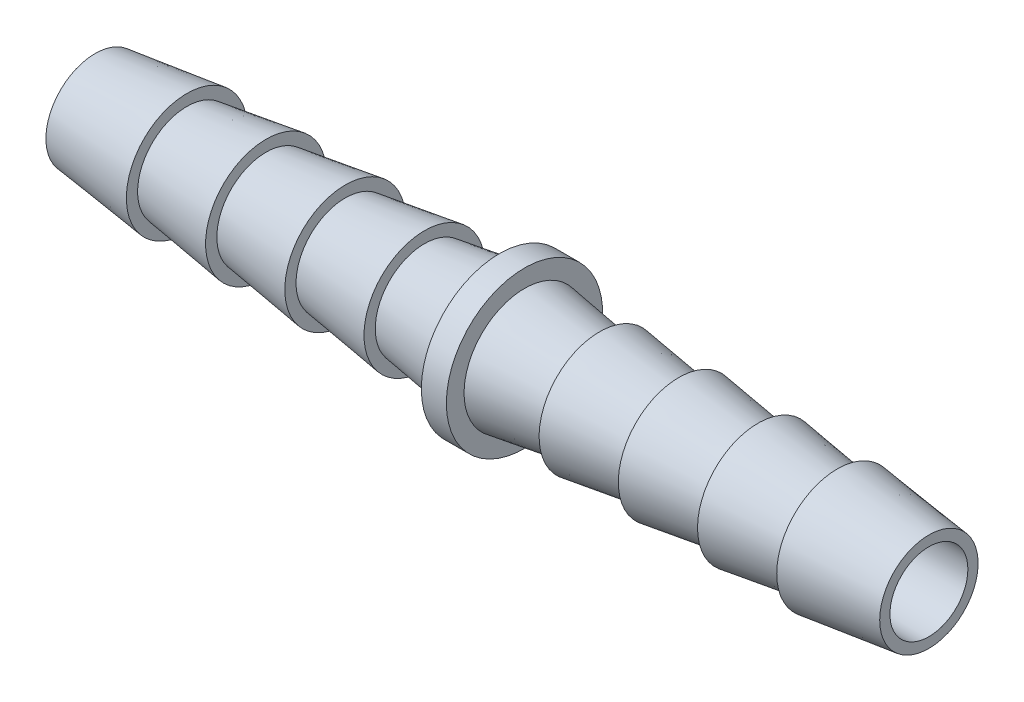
ISO-10303-21;
HEADER;
FILE_DESCRIPTION(('STEP AP214'),'2;1');
FILE_NAME('part.step','',(''),(''),'','','');
FILE_SCHEMA(('AUTOMOTIVE_DESIGN { 1 0 10303 214 1 1 1 1 }'));
ENDSEC;
DATA;
#1=APPLICATION_CONTEXT('core data for automotive mechanical design processes');
#2=APPLICATION_PROTOCOL_DEFINITION('international standard','automotive_design',2000,#1);
#3=PRODUCT_CONTEXT('',#1,'mechanical');
#4=PRODUCT('Part','Part','',(#3));
#5=PRODUCT_RELATED_PRODUCT_CATEGORY('part','',(#4));
#6=PRODUCT_DEFINITION_FORMATION('','',#4);
#7=PRODUCT_DEFINITION_CONTEXT('part definition',#1,'design');
#8=PRODUCT_DEFINITION('design','',#6,#7);
#9=PRODUCT_DEFINITION_SHAPE('','',#8);
#10=(LENGTH_UNIT() NAMED_UNIT(*) SI_UNIT(.MILLI.,.METRE.));
#11=(NAMED_UNIT(*) PLANE_ANGLE_UNIT() SI_UNIT($,.RADIAN.));
#12=(NAMED_UNIT(*) SI_UNIT($,.STERADIAN.) SOLID_ANGLE_UNIT());
#13=UNCERTAINTY_MEASURE_WITH_UNIT(LENGTH_MEASURE(1.E-05),#10,'distance_accuracy_value','');
#14=(GEOMETRIC_REPRESENTATION_CONTEXT(3) GLOBAL_UNCERTAINTY_ASSIGNED_CONTEXT((#13)) GLOBAL_UNIT_ASSIGNED_CONTEXT((#10,
#11,#12)) REPRESENTATION_CONTEXT('',''));
#15=CARTESIAN_POINT('',(0.,0.,0.));
#16=DIRECTION('',(0.,0.,1.));
#17=DIRECTION('',(1.,0.,0.));
#18=AXIS2_PLACEMENT_3D('',#15,#16,#17);
#19=CARTESIAN_POINT('',(0.,0.,0.));
#20=DIRECTION('',(-1.,0.,0.));
#21=DIRECTION('',(0.,0.,1.));
#22=AXIS2_PLACEMENT_3D('',#19,#20,#21);
#23=CYLINDRICAL_SURFACE('',#22,4.7625);
#24=CARTESIAN_POINT('',(-0.762,0.,0.));
#25=DIRECTION('',(-1.,0.,0.));
#26=DIRECTION('',(0.,0.,1.));
#27=AXIS2_PLACEMENT_3D('',#24,#25,#26);
#28=CIRCLE('',#27,4.7625);
#29=CARTESIAN_POINT('',(-0.762,0.,4.7625));
#30=VERTEX_POINT('',#29);
#31=EDGE_CURVE('E17',#30,#30,#28,.T.);
#32=ORIENTED_EDGE('',*,*,#31,.F.);
#33=EDGE_LOOP('',(#32));
#34=FACE_BOUND('',#33,.T.);
#35=CARTESIAN_POINT('',(0.762,0.,0.));
#36=DIRECTION('',(-1.,0.,0.));
#37=DIRECTION('',(0.,0.,1.));
#38=AXIS2_PLACEMENT_3D('',#35,#36,#37);
#39=CIRCLE('',#38,4.7625);
#40=CARTESIAN_POINT('',(0.762,0.,4.7625));
#41=VERTEX_POINT('',#40);
#42=EDGE_CURVE('E87',#41,#41,#39,.T.);
#43=ORIENTED_EDGE('',*,*,#42,.T.);
#44=EDGE_LOOP('',(#43));
#45=FACE_BOUND('',#44,.T.);
#46=ADVANCED_FACE('F13',(#34,#45),#23,.T.);
#47=CARTESIAN_POINT('',(-0.762,0.,0.));
#48=DIRECTION('',(-1.,0.,0.));
#49=DIRECTION('',(0.,0.,1.));
#50=AXIS2_PLACEMENT_3D('',#47,#48,#49);
#51=PLANE('',#50);
#52=CARTESIAN_POINT('',(-0.762,0.,0.));
#53=DIRECTION('',(1.,0.,0.));
#54=DIRECTION('',(0.,0.,-1.));
#55=AXIS2_PLACEMENT_3D('',#52,#53,#54);
#56=CIRCLE('',#55,3.683);
#57=CARTESIAN_POINT('',(-0.762,0.,-3.683));
#58=VERTEX_POINT('',#57);
#59=EDGE_CURVE('E85',#58,#58,#56,.F.);
#60=ORIENTED_EDGE('',*,*,#59,.F.);
#61=EDGE_LOOP('',(#60));
#62=FACE_BOUND('',#61,.T.);
#63=ORIENTED_EDGE('',*,*,#31,.T.);
#64=EDGE_LOOP('',(#63));
#65=FACE_BOUND('',#64,.T.);
#66=ADVANCED_FACE('F94',(#62,#65),#51,.T.);
#67=CARTESIAN_POINT('',(0.762,0.,0.));
#68=DIRECTION('',(-1.,0.,0.));
#69=DIRECTION('',(0.,0.,1.));
#70=AXIS2_PLACEMENT_3D('',#67,#68,#69);
#71=PLANE('',#70);
#72=CARTESIAN_POINT('',(0.761999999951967,0.,0.));
#73=DIRECTION('',(-1.,0.,0.));
#74=DIRECTION('',(0.,-1.,0.));
#75=AXIS2_PLACEMENT_3D('',#72,#73,#74);
#76=CIRCLE('',#75,3.68299999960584);
#77=CARTESIAN_POINT('',(0.761999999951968,-3.68299999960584,0.));
#78=VERTEX_POINT('',#77);
#79=EDGE_CURVE('E82',#78,#78,#76,.F.);
#80=ORIENTED_EDGE('',*,*,#79,.F.);
#81=EDGE_LOOP('',(#80));
#82=FACE_BOUND('',#81,.T.);
#83=ORIENTED_EDGE('',*,*,#42,.F.);
#84=EDGE_LOOP('',(#83));
#85=FACE_BOUND('',#84,.T.);
#86=ADVANCED_FACE('F102',(#82,#85),#71,.F.);
#87=CARTESIAN_POINT('',(-0.762,0.,0.));
#88=DIRECTION('',(1.,0.,0.));
#89=DIRECTION('',(0.,0.,-1.));
#90=AXIS2_PLACEMENT_3D('',#87,#88,#89);
#91=CONICAL_SURFACE('',#90,3.683,0.148889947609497);
#92=ORIENTED_EDGE('',*,*,#59,.T.);
#93=EDGE_LOOP('',(#92));
#94=FACE_BOUND('',#93,.T.);
#95=CARTESIAN_POINT('',(-5.334,0.,0.));
#96=DIRECTION('',(1.,0.,0.));
#97=DIRECTION('',(0.,0.,-1.));
#98=AXIS2_PLACEMENT_3D('',#95,#96,#97);
#99=CIRCLE('',#98,2.9972);
#100=CARTESIAN_POINT('',(-5.334,0.,-2.9972));
#101=VERTEX_POINT('',#100);
#102=EDGE_CURVE('E79',#101,#101,#99,.F.);
#103=ORIENTED_EDGE('',*,*,#102,.F.);
#104=EDGE_LOOP('',(#103));
#105=FACE_BOUND('',#104,.T.);
#106=ADVANCED_FACE('F170',(#94,#105),#91,.T.);
#107=CARTESIAN_POINT('',(0.762000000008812,0.,0.));
#108=DIRECTION('',(-1.,0.,0.));
#109=DIRECTION('',(0.,-1.,0.));
#110=AXIS2_PLACEMENT_3D('',#107,#108,#109);
#111=CONICAL_SURFACE('',#110,3.68299999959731,0.148889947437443);
#112=CARTESIAN_POINT('',(5.33400000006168,0.,0.));
#113=DIRECTION('',(-1.,0.,0.));
#114=DIRECTION('',(0.,-1.,0.));
#115=AXIS2_PLACEMENT_3D('',#112,#113,#114);
#116=CIRCLE('',#115,2.99720000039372);
#117=CARTESIAN_POINT('',(5.33400000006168,-2.99720000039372,0.));
#118=VERTEX_POINT('',#117);
#119=EDGE_CURVE('E76',#118,#118,#116,.F.);
#120=ORIENTED_EDGE('',*,*,#119,.F.);
#121=EDGE_LOOP('',(#120));
#122=FACE_BOUND('',#121,.T.);
#123=ORIENTED_EDGE('',*,*,#79,.T.);
#124=EDGE_LOOP('',(#123));
#125=FACE_BOUND('',#124,.T.);
#126=ADVANCED_FACE('F168',(#122,#125),#111,.T.);
#127=CARTESIAN_POINT('',(-5.334,3.683,-3.75666));
#128=DIRECTION('',(1.,0.,0.));
#129=DIRECTION('',(0.,0.,1.));
#130=AXIS2_PLACEMENT_3D('',#127,#128,#129);
#131=PLANE('',#130);
#132=ORIENTED_EDGE('',*,*,#102,.T.);
#133=EDGE_LOOP('',(#132));
#134=FACE_BOUND('',#133,.T.);
#135=CARTESIAN_POINT('',(-5.334,0.,0.));
#136=DIRECTION('',(1.,0.,0.));
#137=DIRECTION('',(0.,0.,-1.));
#138=AXIS2_PLACEMENT_3D('',#135,#136,#137);
#139=CIRCLE('',#138,3.683);
#140=CARTESIAN_POINT('',(-5.334,0.,-3.683));
#141=VERTEX_POINT('',#140);
#142=EDGE_CURVE('E73',#141,#141,#139,.F.);
#143=ORIENTED_EDGE('',*,*,#142,.F.);
#144=EDGE_LOOP('',(#143));
#145=FACE_BOUND('',#144,.T.);
#146=ADVANCED_FACE('F166',(#134,#145),#131,.T.);
#147=CARTESIAN_POINT('',(5.334,3.3401,0.));
#148=DIRECTION('',(-1.,0.,0.));
#149=DIRECTION('',(0.,0.,1.));
#150=AXIS2_PLACEMENT_3D('',#147,#148,#149);
#151=PLANE('',#150);
#152=ORIENTED_EDGE('',*,*,#119,.T.);
#153=EDGE_LOOP('',(#152));
#154=FACE_BOUND('',#153,.T.);
#155=CARTESIAN_POINT('',(5.33399999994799,0.,0.));
#156=DIRECTION('',(-1.,0.,0.));
#157=DIRECTION('',(0.,-1.,0.));
#158=AXIS2_PLACEMENT_3D('',#155,#156,#157);
#159=CIRCLE('',#158,3.6829999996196);
#160=CARTESIAN_POINT('',(5.33399999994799,-3.6829999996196,0.));
#161=VERTEX_POINT('',#160);
#162=EDGE_CURVE('E70',#161,#161,#159,.F.);
#163=ORIENTED_EDGE('',*,*,#162,.F.);
#164=EDGE_LOOP('',(#163));
#165=FACE_BOUND('',#164,.T.);
#166=ADVANCED_FACE('F164',(#154,#165),#151,.T.);
#167=CARTESIAN_POINT('',(-5.334,0.,0.));
#168=DIRECTION('',(1.,0.,0.));
#169=DIRECTION('',(0.,0.,-1.));
#170=AXIS2_PLACEMENT_3D('',#167,#168,#169);
#171=CONICAL_SURFACE('',#170,3.683,0.141160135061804);
#172=ORIENTED_EDGE('',*,*,#142,.T.);
#173=EDGE_LOOP('',(#172));
#174=FACE_BOUND('',#173,.T.);
#175=CARTESIAN_POINT('',(-10.16,0.,0.));
#176=DIRECTION('',(1.,0.,0.));
#177=DIRECTION('',(0.,0.,-1.));
#178=AXIS2_PLACEMENT_3D('',#175,#176,#177);
#179=CIRCLE('',#178,2.9972);
#180=CARTESIAN_POINT('',(-10.16,0.,-2.9972));
#181=VERTEX_POINT('',#180);
#182=EDGE_CURVE('E67',#181,#181,#179,.F.);
#183=ORIENTED_EDGE('',*,*,#182,.F.);
#184=EDGE_LOOP('',(#183));
#185=FACE_BOUND('',#184,.T.);
#186=ADVANCED_FACE('F161',(#174,#185),#171,.T.);
#187=CARTESIAN_POINT('',(5.33400000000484,0.,0.));
#188=DIRECTION('',(-1.,0.,0.));
#189=DIRECTION('',(0.,-1.,0.));
#190=AXIS2_PLACEMENT_3D('',#187,#188,#189);
#191=CONICAL_SURFACE('',#190,3.68299999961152,0.141160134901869);
#192=CARTESIAN_POINT('',(10.1600000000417,0.,0.));
#193=DIRECTION('',(-1.,0.,0.));
#194=DIRECTION('',(0.,-1.,0.));
#195=AXIS2_PLACEMENT_3D('',#192,#193,#194);
#196=CIRCLE('',#195,2.99720000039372);
#197=CARTESIAN_POINT('',(10.1600000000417,-2.99720000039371,0.));
#198=VERTEX_POINT('',#197);
#199=EDGE_CURVE('E64',#198,#198,#196,.F.);
#200=ORIENTED_EDGE('',*,*,#199,.F.);
#201=EDGE_LOOP('',(#200));
#202=FACE_BOUND('',#201,.T.);
#203=ORIENTED_EDGE('',*,*,#162,.T.);
#204=EDGE_LOOP('',(#203));
#205=FACE_BOUND('',#204,.T.);
#206=ADVANCED_FACE('F159',(#202,#205),#191,.T.);
#207=CARTESIAN_POINT('',(-10.16,3.683,-3.75666));
#208=DIRECTION('',(1.,0.,0.));
#209=DIRECTION('',(0.,0.,1.));
#210=AXIS2_PLACEMENT_3D('',#207,#208,#209);
#211=PLANE('',#210);
#212=ORIENTED_EDGE('',*,*,#182,.T.);
#213=EDGE_LOOP('',(#212));
#214=FACE_BOUND('',#213,.T.);
#215=CARTESIAN_POINT('',(-10.16,0.,0.));
#216=DIRECTION('',(1.,0.,0.));
#217=DIRECTION('',(0.,0.,-1.));
#218=AXIS2_PLACEMENT_3D('',#215,#216,#217);
#219=CIRCLE('',#218,3.683);
#220=CARTESIAN_POINT('',(-10.16,0.,-3.683));
#221=VERTEX_POINT('',#220);
#222=EDGE_CURVE('E61',#221,#221,#219,.F.);
#223=ORIENTED_EDGE('',*,*,#222,.F.);
#224=EDGE_LOOP('',(#223));
#225=FACE_BOUND('',#224,.T.);
#226=ADVANCED_FACE('F156',(#214,#225),#211,.T.);
#227=CARTESIAN_POINT('',(10.16,3.3401,0.));
#228=DIRECTION('',(-1.,0.,0.));
#229=DIRECTION('',(0.,0.,1.));
#230=AXIS2_PLACEMENT_3D('',#227,#228,#229);
#231=PLANE('',#230);
#232=ORIENTED_EDGE('',*,*,#199,.T.);
#233=EDGE_LOOP('',(#232));
#234=FACE_BOUND('',#233,.T.);
#235=CARTESIAN_POINT('',(10.159999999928,0.,0.));
#236=DIRECTION('',(-1.,0.,0.));
#237=DIRECTION('',(0.,-1.,0.));
#238=AXIS2_PLACEMENT_3D('',#235,#236,#237);
#239=CIRCLE('',#238,3.68299999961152);
#240=CARTESIAN_POINT('',(10.159999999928,-3.68299999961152,0.));
#241=VERTEX_POINT('',#240);
#242=EDGE_CURVE('E58',#241,#241,#239,.F.);
#243=ORIENTED_EDGE('',*,*,#242,.F.);
#244=EDGE_LOOP('',(#243));
#245=FACE_BOUND('',#244,.T.);
#246=ADVANCED_FACE('F154',(#234,#245),#231,.T.);
#247=CARTESIAN_POINT('',(-10.16,0.,0.));
#248=DIRECTION('',(1.,0.,0.));
#249=DIRECTION('',(0.,0.,-1.));
#250=AXIS2_PLACEMENT_3D('',#247,#248,#249);
#251=CONICAL_SURFACE('',#250,3.683,0.141160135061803);
#252=ORIENTED_EDGE('',*,*,#222,.T.);
#253=EDGE_LOOP('',(#252));
#254=FACE_BOUND('',#253,.T.);
#255=CARTESIAN_POINT('',(-14.986,0.,0.));
#256=DIRECTION('',(1.,0.,0.));
#257=DIRECTION('',(0.,0.,-1.));
#258=AXIS2_PLACEMENT_3D('',#255,#256,#257);
#259=CIRCLE('',#258,2.9972);
#260=CARTESIAN_POINT('',(-14.986,0.,-2.9972));
#261=VERTEX_POINT('',#260);
#262=EDGE_CURVE('E55',#261,#261,#259,.F.);
#263=ORIENTED_EDGE('',*,*,#262,.F.);
#264=EDGE_LOOP('',(#263));
#265=FACE_BOUND('',#264,.T.);
#266=ADVANCED_FACE('F151',(#254,#265),#251,.T.);
#267=CARTESIAN_POINT('',(10.159999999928,0.,0.));
#268=DIRECTION('',(-1.,0.,0.));
#269=DIRECTION('',(0.,-1.,0.));
#270=AXIS2_PLACEMENT_3D('',#267,#268,#269);
#271=CONICAL_SURFACE('',#270,3.68299999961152,0.141160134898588);
#272=CARTESIAN_POINT('',(14.9860000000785,0.,0.));
#273=DIRECTION('',(-1.,0.,0.));
#274=DIRECTION('',(0.,-1.,0.));
#275=AXIS2_PLACEMENT_3D('',#272,#273,#274);
#276=CIRCLE('',#275,2.99720000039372);
#277=CARTESIAN_POINT('',(14.9860000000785,-2.99720000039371,0.));
#278=VERTEX_POINT('',#277);
#279=EDGE_CURVE('E52',#278,#278,#276,.F.);
#280=ORIENTED_EDGE('',*,*,#279,.F.);
#281=EDGE_LOOP('',(#280));
#282=FACE_BOUND('',#281,.T.);
#283=ORIENTED_EDGE('',*,*,#242,.T.);
#284=EDGE_LOOP('',(#283));
#285=FACE_BOUND('',#284,.T.);
#286=ADVANCED_FACE('F149',(#282,#285),#271,.T.);
#287=CARTESIAN_POINT('',(-14.986,3.683,-3.75666));
#288=DIRECTION('',(1.,0.,0.));
#289=DIRECTION('',(0.,0.,1.));
#290=AXIS2_PLACEMENT_3D('',#287,#288,#289);
#291=PLANE('',#290);
#292=ORIENTED_EDGE('',*,*,#262,.T.);
#293=EDGE_LOOP('',(#292));
#294=FACE_BOUND('',#293,.T.);
#295=CARTESIAN_POINT('',(-14.986,0.,0.));
#296=DIRECTION('',(1.,0.,0.));
#297=DIRECTION('',(0.,0.,-1.));
#298=AXIS2_PLACEMENT_3D('',#295,#296,#297);
#299=CIRCLE('',#298,3.683);
#300=CARTESIAN_POINT('',(-14.986,0.,-3.683));
#301=VERTEX_POINT('',#300);
#302=EDGE_CURVE('E49',#301,#301,#299,.F.);
#303=ORIENTED_EDGE('',*,*,#302,.F.);
#304=EDGE_LOOP('',(#303));
#305=FACE_BOUND('',#304,.T.);
#306=ADVANCED_FACE('F146',(#294,#305),#291,.T.);
#307=CARTESIAN_POINT('',(14.986,3.3401,0.));
#308=DIRECTION('',(-1.,0.,0.));
#309=DIRECTION('',(0.,0.,1.));
#310=AXIS2_PLACEMENT_3D('',#307,#308,#309);
#311=PLANE('',#310);
#312=ORIENTED_EDGE('',*,*,#279,.T.);
#313=EDGE_LOOP('',(#312));
#314=FACE_BOUND('',#313,.T.);
#315=CARTESIAN_POINT('',(14.9859999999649,0.,0.));
#316=DIRECTION('',(-1.,0.,0.));
#317=DIRECTION('',(0.,0.,1.));
#318=AXIS2_PLACEMENT_3D('',#315,#316,#317);
#319=CIRCLE('',#318,3.68299999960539);
#320=CARTESIAN_POINT('',(14.9859999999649,0.,3.68299999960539));
#321=VERTEX_POINT('',#320);
#322=EDGE_CURVE('E46',#321,#321,#319,.F.);
#323=ORIENTED_EDGE('',*,*,#322,.F.);
#324=EDGE_LOOP('',(#323));
#325=FACE_BOUND('',#324,.T.);
#326=ADVANCED_FACE('F144',(#314,#325),#311,.T.);
#327=CARTESIAN_POINT('',(-14.986,0.,0.));
#328=DIRECTION('',(1.,0.,0.));
#329=DIRECTION('',(0.,0.,-1.));
#330=AXIS2_PLACEMENT_3D('',#327,#328,#329);
#331=CONICAL_SURFACE('',#330,3.683,0.141160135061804);
#332=ORIENTED_EDGE('',*,*,#302,.T.);
#333=EDGE_LOOP('',(#332));
#334=FACE_BOUND('',#333,.T.);
#335=CARTESIAN_POINT('',(-19.812,0.,0.));
#336=DIRECTION('',(1.,0.,0.));
#337=DIRECTION('',(0.,0.,-1.));
#338=AXIS2_PLACEMENT_3D('',#335,#336,#337);
#339=CIRCLE('',#338,2.9972);
#340=CARTESIAN_POINT('',(-19.812,0.,-2.9972));
#341=VERTEX_POINT('',#340);
#342=EDGE_CURVE('E43',#341,#341,#339,.F.);
#343=ORIENTED_EDGE('',*,*,#342,.F.);
#344=EDGE_LOOP('',(#343));
#345=FACE_BOUND('',#344,.T.);
#346=ADVANCED_FACE('F141',(#334,#345),#331,.T.);
#347=CARTESIAN_POINT('',(14.9860000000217,0.,0.));
#348=DIRECTION('',(-1.,0.,0.));
#349=DIRECTION('',(0.,0.,1.));
#350=AXIS2_PLACEMENT_3D('',#347,#348,#349);
#351=CONICAL_SURFACE('',#350,3.68299999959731,0.141160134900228);
#352=CARTESIAN_POINT('',(19.8120000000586,0.,0.));
#353=DIRECTION('',(-1.,0.,0.));
#354=DIRECTION('',(0.,0.,1.));
#355=AXIS2_PLACEMENT_3D('',#352,#353,#354);
#356=CIRCLE('',#355,2.99720000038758);
#357=CARTESIAN_POINT('',(19.8120000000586,0.,2.99720000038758));
#358=VERTEX_POINT('',#357);
#359=EDGE_CURVE('E40',#358,#358,#356,.F.);
#360=ORIENTED_EDGE('',*,*,#359,.F.);
#361=EDGE_LOOP('',(#360));
#362=FACE_BOUND('',#361,.T.);
#363=ORIENTED_EDGE('',*,*,#322,.T.);
#364=EDGE_LOOP('',(#363));
#365=FACE_BOUND('',#364,.T.);
#366=ADVANCED_FACE('F139',(#362,#365),#351,.T.);
#367=CARTESIAN_POINT('',(-19.812,3.683,-3.75666));
#368=DIRECTION('',(1.,0.,0.));
#369=DIRECTION('',(0.,0.,1.));
#370=AXIS2_PLACEMENT_3D('',#367,#368,#369);
#371=PLANE('',#370);
#372=ORIENTED_EDGE('',*,*,#342,.T.);
#373=EDGE_LOOP('',(#372));
#374=FACE_BOUND('',#373,.T.);
#375=CARTESIAN_POINT('',(-19.812,0.,0.));
#376=DIRECTION('',(1.,0.,0.));
#377=DIRECTION('',(0.,0.,-1.));
#378=AXIS2_PLACEMENT_3D('',#375,#376,#377);
#379=CIRCLE('',#378,3.683);
#380=CARTESIAN_POINT('',(-19.812,0.,-3.683));
#381=VERTEX_POINT('',#380);
#382=EDGE_CURVE('E37',#381,#381,#379,.F.);
#383=ORIENTED_EDGE('',*,*,#382,.F.);
#384=EDGE_LOOP('',(#383));
#385=FACE_BOUND('',#384,.T.);
#386=ADVANCED_FACE('F133',(#374,#385),#371,.T.);
#387=CARTESIAN_POINT('',(19.812,1.8415,0.));
#388=DIRECTION('',(-1.,0.,0.));
#389=DIRECTION('',(0.,0.,1.));
#390=AXIS2_PLACEMENT_3D('',#387,#388,#389);
#391=PLANE('',#390);
#392=ORIENTED_EDGE('',*,*,#359,.T.);
#393=EDGE_LOOP('',(#392));
#394=FACE_BOUND('',#393,.T.);
#395=CARTESIAN_POINT('',(19.8119999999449,0.,0.));
#396=DIRECTION('',(-1.,0.,0.));
#397=DIRECTION('',(0.,0.,1.));
#398=AXIS2_PLACEMENT_3D('',#395,#396,#397);
#399=CIRCLE('',#398,3.68299999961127);
#400=CARTESIAN_POINT('',(19.8119999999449,0.,3.68299999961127));
#401=VERTEX_POINT('',#400);
#402=EDGE_CURVE('E34',#401,#401,#399,.F.);
#403=ORIENTED_EDGE('',*,*,#402,.F.);
#404=EDGE_LOOP('',(#403));
#405=FACE_BOUND('',#404,.T.);
#406=ADVANCED_FACE('F124',(#394,#405),#391,.T.);
#407=CARTESIAN_POINT('',(-19.812,0.,0.));
#408=DIRECTION('',(1.,0.,0.));
#409=DIRECTION('',(0.,0.,-1.));
#410=AXIS2_PLACEMENT_3D('',#407,#408,#409);
#411=CONICAL_SURFACE('',#410,3.683,0.122116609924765);
#412=ORIENTED_EDGE('',*,*,#382,.T.);
#413=EDGE_LOOP('',(#412));
#414=FACE_BOUND('',#413,.T.);
#415=CARTESIAN_POINT('',(-25.4,0.,0.));
#416=DIRECTION('',(1.,0.,0.));
#417=DIRECTION('',(0.,0.,-1.));
#418=AXIS2_PLACEMENT_3D('',#415,#416,#417);
#419=CIRCLE('',#418,2.9972);
#420=CARTESIAN_POINT('',(-25.4,0.,-2.9972));
#421=VERTEX_POINT('',#420);
#422=EDGE_CURVE('E31',#421,#421,#419,.F.);
#423=ORIENTED_EDGE('',*,*,#422,.F.);
#424=EDGE_LOOP('',(#423));
#425=FACE_BOUND('',#424,.T.);
#426=ADVANCED_FACE('F122',(#414,#425),#411,.T.);
#427=CARTESIAN_POINT('',(19.8120000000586,0.,0.));
#428=DIRECTION('',(-1.,0.,0.));
#429=DIRECTION('',(0.,0.,1.));
#430=AXIS2_PLACEMENT_3D('',#427,#428,#429);
#431=CONICAL_SURFACE('',#430,3.68299999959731,0.122116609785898);
#432=CARTESIAN_POINT('',(25.4000000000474,0.,0.));
#433=DIRECTION('',(-1.,0.,0.));
#434=DIRECTION('',(0.,0.,1.));
#435=AXIS2_PLACEMENT_3D('',#432,#433,#434);
#436=CIRCLE('',#435,2.99720000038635);
#437=CARTESIAN_POINT('',(25.4000000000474,0.,2.99720000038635));
#438=VERTEX_POINT('',#437);
#439=EDGE_CURVE('E26',#438,#438,#436,.F.);
#440=ORIENTED_EDGE('',*,*,#439,.F.);
#441=EDGE_LOOP('',(#440));
#442=FACE_BOUND('',#441,.T.);
#443=ORIENTED_EDGE('',*,*,#402,.T.);
#444=EDGE_LOOP('',(#443));
#445=FACE_BOUND('',#444,.T.);
#446=ADVANCED_FACE('F119',(#442,#445),#431,.T.);
#447=CARTESIAN_POINT('',(-25.4,2.9972,3.057144));
#448=DIRECTION('',(-1.,0.,0.));
#449=DIRECTION('',(0.,0.,-1.));
#450=AXIS2_PLACEMENT_3D('',#447,#448,#449);
#451=PLANE('',#450);
#452=CARTESIAN_POINT('',(-25.4,0.,0.));
#453=DIRECTION('',(1.,0.,0.));
#454=DIRECTION('',(0.,0.,-1.));
#455=AXIS2_PLACEMENT_3D('',#452,#453,#454);
#456=CIRCLE('',#455,2.3749);
#457=CARTESIAN_POINT('',(-25.4,0.,-2.3749));
#458=VERTEX_POINT('',#457);
#459=EDGE_CURVE('E21',#458,#458,#456,.T.);
#460=ORIENTED_EDGE('',*,*,#459,.T.);
#461=EDGE_LOOP('',(#460));
#462=FACE_BOUND('',#461,.T.);
#463=ORIENTED_EDGE('',*,*,#422,.T.);
#464=EDGE_LOOP('',(#463));
#465=FACE_BOUND('',#464,.T.);
#466=ADVANCED_FACE('F112',(#462,#465),#451,.T.);
#467=CARTESIAN_POINT('',(25.4,1.4986,0.));
#468=DIRECTION('',(1.,0.,0.));
#469=DIRECTION('',(0.,0.,-1.));
#470=AXIS2_PLACEMENT_3D('',#467,#468,#469);
#471=PLANE('',#470);
#472=CARTESIAN_POINT('',(25.4,0.,0.));
#473=DIRECTION('',(1.,0.,0.));
#474=DIRECTION('',(0.,0.,-1.));
#475=AXIS2_PLACEMENT_3D('',#472,#473,#474);
#476=CIRCLE('',#475,2.3749);
#477=CARTESIAN_POINT('',(25.4,0.,-2.3749));
#478=VERTEX_POINT('',#477);
#479=EDGE_CURVE('E9',#478,#478,#476,.F.);
#480=ORIENTED_EDGE('',*,*,#479,.T.);
#481=EDGE_LOOP('',(#480));
#482=FACE_BOUND('',#481,.T.);
#483=ORIENTED_EDGE('',*,*,#439,.T.);
#484=EDGE_LOOP('',(#483));
#485=FACE_BOUND('',#484,.T.);
#486=ADVANCED_FACE('F107',(#482,#485),#471,.T.);
#487=CARTESIAN_POINT('',(-25.4,0.,0.));
#488=DIRECTION('',(1.,0.,0.));
#489=DIRECTION('',(0.,0.,-1.));
#490=AXIS2_PLACEMENT_3D('',#487,#488,#489);
#491=CYLINDRICAL_SURFACE('',#490,2.3749);
#492=ORIENTED_EDGE('',*,*,#479,.F.);
#493=EDGE_LOOP('',(#492));
#494=FACE_BOUND('',#493,.T.);
#495=ORIENTED_EDGE('',*,*,#459,.F.);
#496=EDGE_LOOP('',(#495));
#497=FACE_BOUND('',#496,.T.);
#498=ADVANCED_FACE('F15',(#494,#497),#491,.F.);
#499=CLOSED_SHELL('',(#46,#66,#86,#106,#126,#146,#166,#186,#206,#226,#246,#266,#286,#306,#326,
#346,#366,#386,#406,#426,#446,#466,#486,#498));
#500=MANIFOLD_SOLID_BREP('B1',#499);
#501=ADVANCED_BREP_SHAPE_REPRESENTATION('',(#18,#500),#14);
#502=SHAPE_DEFINITION_REPRESENTATION(#9,#501);
ENDSEC;
END-ISO-10303-21;
